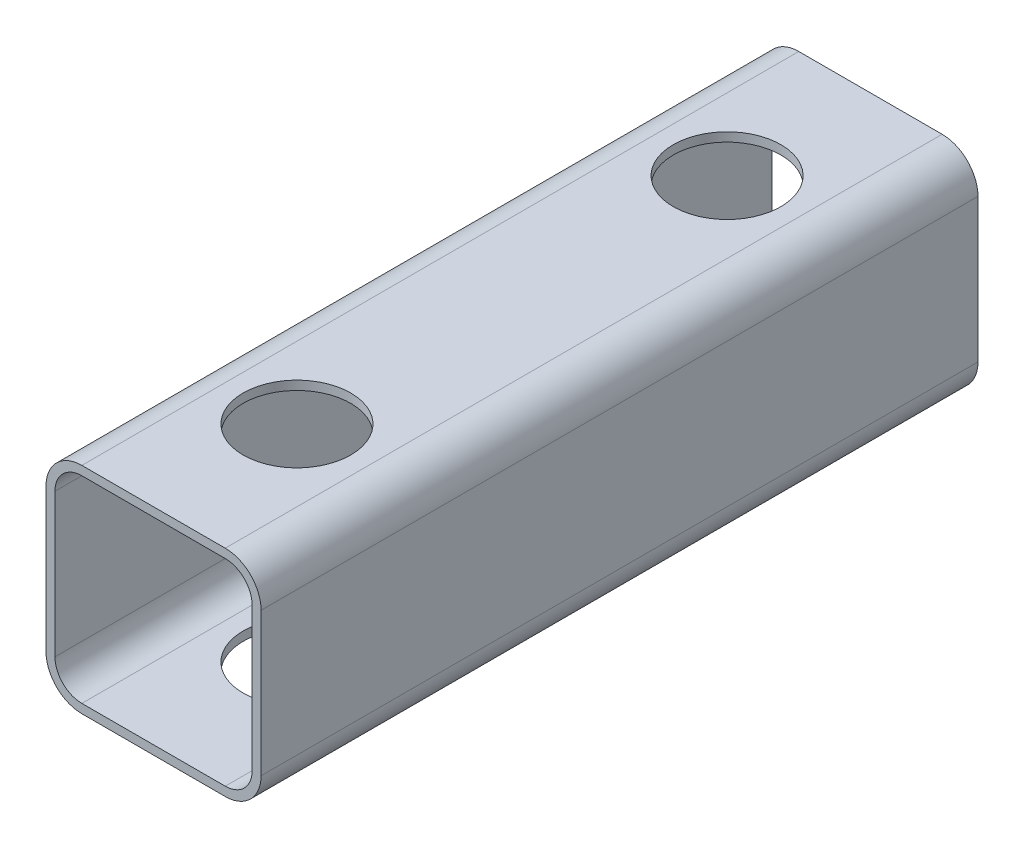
from build123d import *

# Parameters (mm, degrees)
BASE_EXTRUDE_THIN_DEPTH = 254
SKETCH2_R               = 19.05
CUT_EXTRUDE1_DEPTH      = 268.906793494


with BuildPart() as part:
    # Sketch1 → Base-Extrude-Thin (new body)
    with BuildSketch(Plane.XY):
        with BuildLine():
            Line((-25.4, 38.1), (25.4, 38.1))
            ThreePointArc((25.4, 38.1), (34.380256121, 34.380256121), (38.1, 25.4))
            Line((38.1, 25.4), (38.1, -25.4))
            ThreePointArc((38.1, -25.4), (34.380256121, -34.380256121), (25.4, -38.1))
            Line((25.4, -38.1), (-25.4, -38.1))
            ThreePointArc((-25.4, -38.1), (-34.380256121, -34.380256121), (-38.1, -25.4))
            Line((-38.1, -25.4), (-38.1, 25.4))
            ThreePointArc((-38.1, 25.4), (-34.380256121, 34.380256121), (-25.4, 38.1))
        make_face()
        with BuildLine():
            Line((-25.4, 34.925), (25.4, 34.925))
            ThreePointArc((25.4, 34.925), (32.135192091, 32.135192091), (34.925, 25.4))
            Line((34.925, 25.4), (34.925, -25.4))
            ThreePointArc((34.925, -25.4), (32.135192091, -32.135192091), (25.4, -34.925))
            Line((25.4, -34.925), (-25.4, -34.925))
            ThreePointArc((-25.4, -34.925), (-32.135192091, -32.135192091), (-34.925, -25.4))
            Line((-34.925, -25.4), (-34.925, 25.4))
            ThreePointArc((-34.925, 25.4), (-32.135192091, 32.135192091), (-25.4, 34.925))
        make_face(mode=Mode.SUBTRACT)
    extrude(amount=BASE_EXTRUDE_THIN_DEPTH)

    # Sketch2 → Cut-Extrude1 (cut, through all)
    with BuildSketch(Plane(origin=(0, 38.1, 0), x_dir=(-1, 0, 0), z_dir=(0, 1, 0))):
        with Locations((0, 50.8)):
            Circle(SKETCH2_R)
        with Locations(Location((0, 203.2, 0), (0, 0, 180))):
            Circle(SKETCH2_R)
    extrude(amount=-CUT_EXTRUDE1_DEPTH, mode=Mode.SUBTRACT)


solid = part.part
